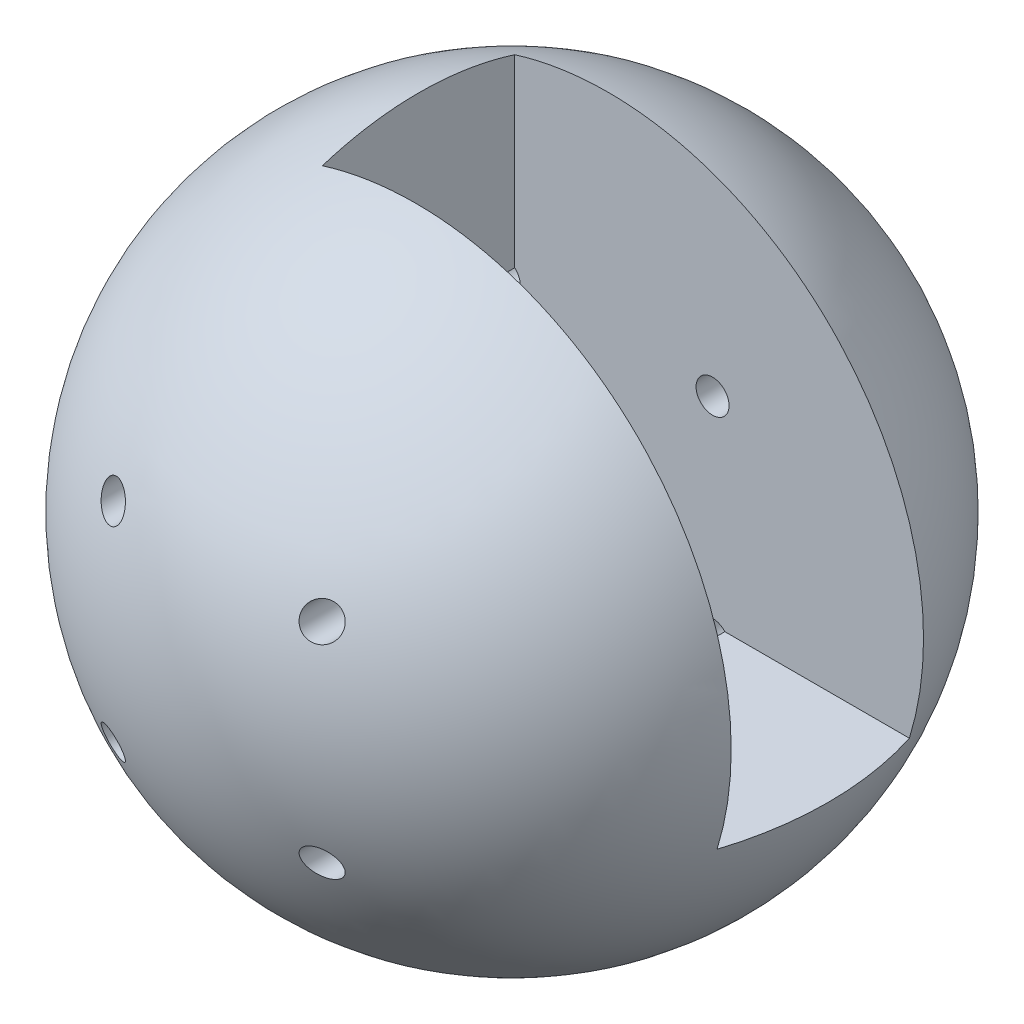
from build123d import *

# Parameters (mm, degrees)
ESQUISSE2_W                  = 119.495906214
ESQUISSE2_H                  = 106.513297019
ENL_V_MAT_EXTRU_1_DEPTH      = 17.5
ENL_V_MAT_EXTRU_2_DEPTH      = 104.923048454
ENL_V_MAT_EXTRU_2_DEPTH_BACK = 104.923048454
ESQUISSE3_R                  = 3


with BuildPart() as part:
    # Esquisse1 → R_volution1 (revolve)
    with BuildSketch(Plane.XY):
        with BuildLine():
            Line((0, 60), (0, -60))
            ThreePointArc((0, -60), (-60, 0), (0, 60))
        make_face()
    revolve(axis=Axis((0, 0, 0), (0, 1, 0)))

    # Esquisse2 → Enl_v. mat.-Extru.1 (cut, symmetric)
    with BuildSketch(Plane.XY):
        with Locations((42.747953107, 36.25664851)):
            Rectangle(ESQUISSE2_W, ESQUISSE2_H)
    extrude(amount=ENL_V_MAT_EXTRU_1_DEPTH, both=True, mode=Mode.SUBTRACT)

    # Esquisse3 → Enl_v. mat.-Extru.2 (cut, two sides: drawn at the far end of the back side and taken through both)
    with BuildSketch(Plane.XY.offset(-ENL_V_MAT_EXTRU_2_DEPTH_BACK)):
        with Locations(Location((-19, 19, 0), (0, 0, 258.935143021))):
            Circle(ESQUISSE3_R)
        with Locations(Location((19, 19, 0), (0, 0, 98.867971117))):
            Circle(ESQUISSE3_R)
        with Locations(Location((19, -19, 0), (0, 0, 261.132028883))):
            Circle(ESQUISSE3_R)
        with Locations(Location((-19, -19, 0), (0, 0, 225))):
            Circle(ESQUISSE3_R)
    extrude(amount=ENL_V_MAT_EXTRU_2_DEPTH + ENL_V_MAT_EXTRU_2_DEPTH_BACK, mode=Mode.SUBTRACT)


solid = part.part
